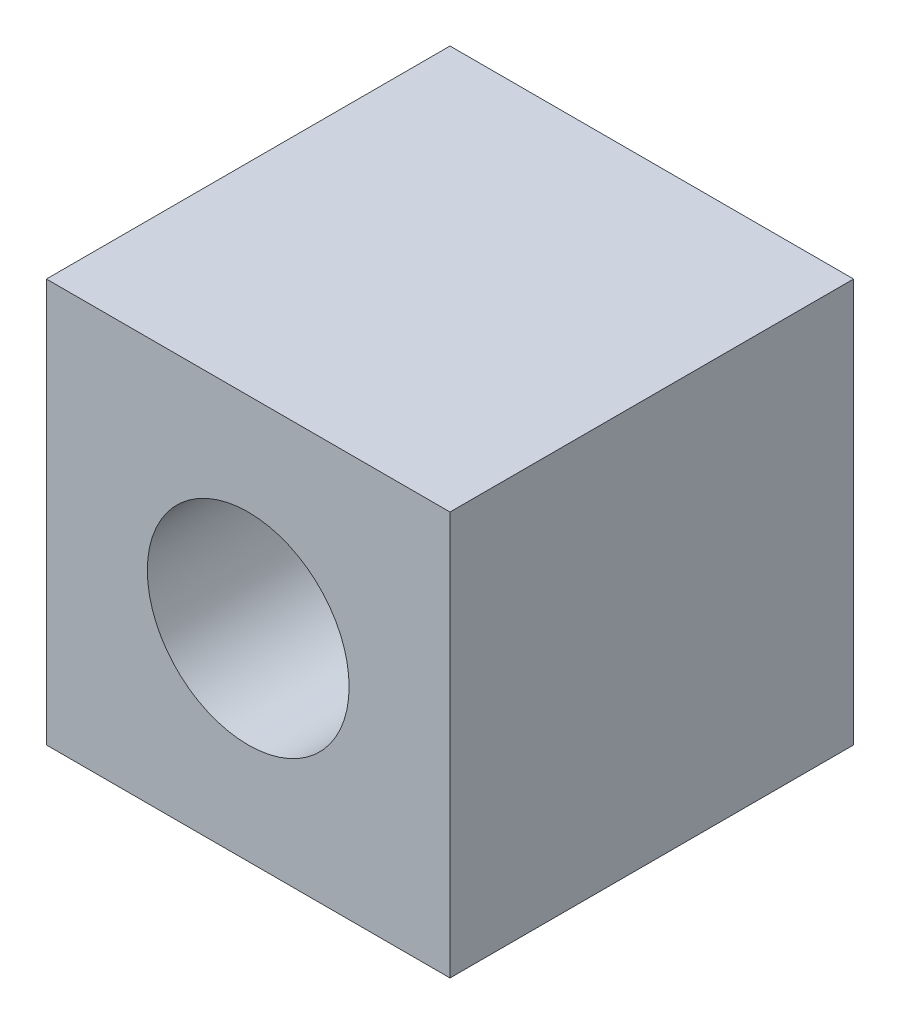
from build123d import *

# Parameters (mm, degrees)
SKETCH1_W               = 10
SKETCH1_H               = 10
BOSS_EXTRUDE1_DEPTH     = 5
CUT_EXTRUDE1_DEPTH      = 9.660254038
CUT_EXTRUDE1_DEPTH_BACK = 9.660254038
SKETCH2_R               = 2.5


with BuildPart() as part:
    # Sketch1 → Boss-Extrude1 (new, symmetric)
    with BuildSketch(Plane.XY):
        Rectangle(SKETCH1_W, SKETCH1_H)
    extrude(amount=BOSS_EXTRUDE1_DEPTH, both=True)

    # Sketch2 → Cut-Extrude1 (cut, two sides: drawn at the far end of the back side and taken through both)
    with BuildSketch(Plane.XY.offset(-CUT_EXTRUDE1_DEPTH_BACK)):
        Circle(SKETCH2_R)
    extrude(amount=CUT_EXTRUDE1_DEPTH + CUT_EXTRUDE1_DEPTH_BACK, mode=Mode.SUBTRACT)


solid = part.part
